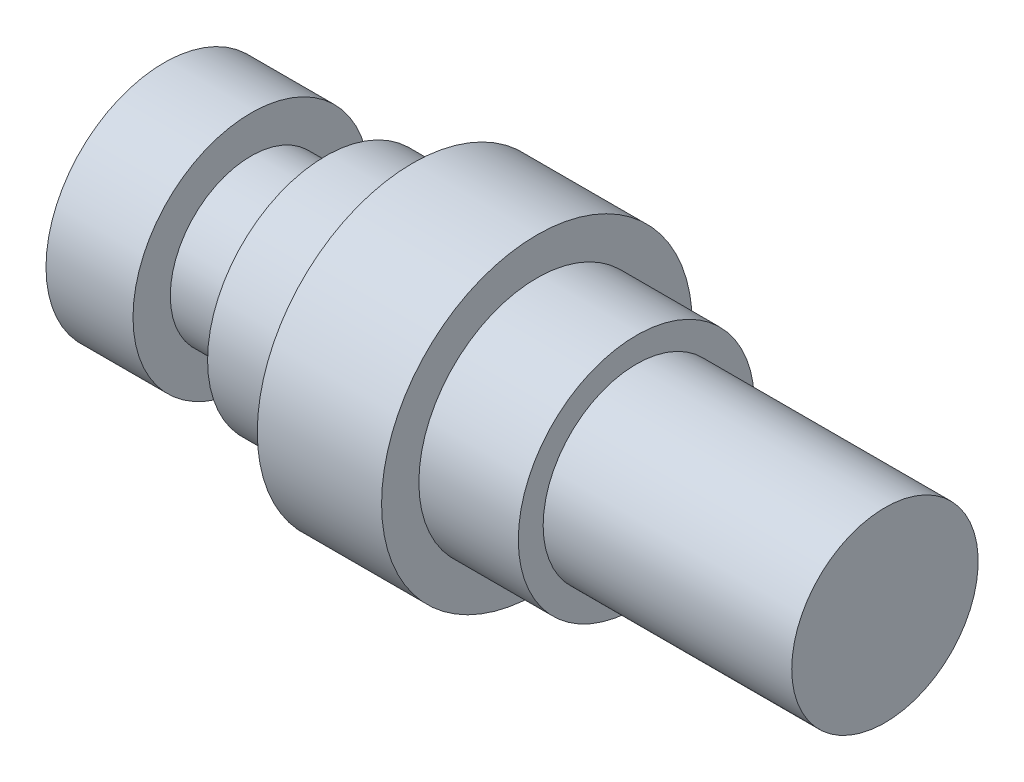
from build123d import *


with BuildPart() as part:
    # Sketch1 → Revolve1 (revolve)
    with BuildSketch(Plane.XY, mode=Mode.PRIVATE) as revolve1_sk:
        Polygon((-70.682926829, 0), (-70.682926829, 9.5), (-63.682926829, 9.5), (-63.682926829, 6.5), (-57.682926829, 6.5), (-57.682926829, 9.5), (-50.682926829, 9.5), (-50.682926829, 12.5), (-40.682926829, 12.5), (-40.682926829, 9.5), (-32.682926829, 9.5), (-32.682926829, 7.5), (-12.682926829, 7.5), (-12.682926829, 0), align=None)
    revolve(revolve1_sk.sketch.rotate(Axis((-78.024390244, 0, 0), (1, 0, 0)), 90), axis=Axis((-78.024390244, 0, 0), (1, 0, 0)))


solid = part.part
